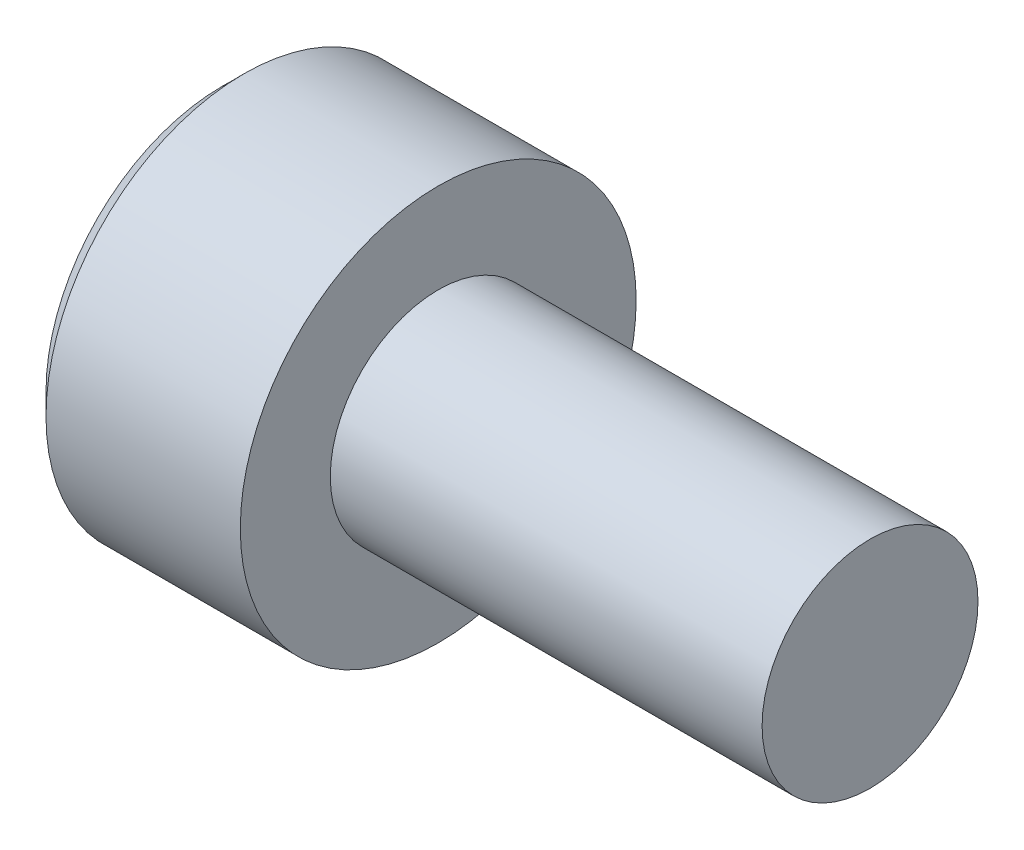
from build123d import *

# Parameters (mm, degrees)
CHAMFER1_SIZE      = 0.3
CUT_EXTRUDE1_DEPTH = 1.3


with BuildPart() as part:
    # Sketch1 → Revolve1 (revolve)
    with BuildSketch(Plane.XY, mode=Mode.PRIVATE) as revolve1_sk:
        Polygon((-3, 0), (6, 0), (6, 1.5), (0, 1.5), (0, 2.75), (-3, 2.75), align=None)
    revolve(revolve1_sk.sketch.rotate(Axis((-3, 0, 0), (1, 0, 0)), 90), axis=Axis((-3, 0, 0), (1, 0, 0)))

    # Chamfer1
    chamfer1_edges = [part.edges().sort_by_distance(p)[0] for p in [
        (-3, 0, -2.75),
    ]]
    chamfer(chamfer1_edges, length=CHAMFER1_SIZE)

    # Sketch2 → Cut-Revolve1 (revolve, cut)
    with BuildSketch(Plane.XY, mode=Mode.PRIVATE) as cut_revolve1_sk:
        Polygon((-0.948924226, 0), (-1.7, 1.25), (-3, 1.25), (-3, 0), align=None)
    revolve(cut_revolve1_sk.sketch.rotate(Axis((-3, 0, 0), (1, 0, 0)), 180), axis=Axis((-3, 0, 0), (1, 0, 0)), mode=Mode.SUBTRACT)

    # Sketch3 → Cut-Extrude1 (cut)
    with BuildSketch(Plane.ZY.offset(3)):
        Polygon((0, -1.443375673), (1.25, -0.721687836), (1.25, 0.721687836), (0, 1.443375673), (-1.25, 0.721687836), (-1.25, -0.721687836), align=None)
    extrude(amount=-CUT_EXTRUDE1_DEPTH, mode=Mode.SUBTRACT)


solid = part.part
